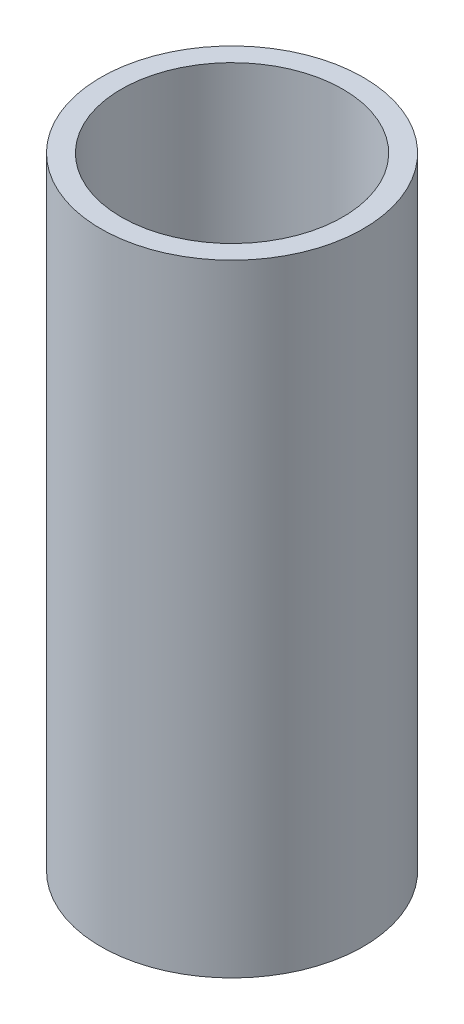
ISO-10303-21;
HEADER;
FILE_DESCRIPTION(('STEP AP214'),'2;1');
FILE_NAME('part.step','',(''),(''),'','','');
FILE_SCHEMA(('AUTOMOTIVE_DESIGN { 1 0 10303 214 1 1 1 1 }'));
ENDSEC;
DATA;
#1=APPLICATION_CONTEXT('core data for automotive mechanical design processes');
#2=APPLICATION_PROTOCOL_DEFINITION('international standard','automotive_design',2000,#1);
#3=PRODUCT_CONTEXT('',#1,'mechanical');
#4=PRODUCT('Part','Part','',(#3));
#5=PRODUCT_RELATED_PRODUCT_CATEGORY('part','',(#4));
#6=PRODUCT_DEFINITION_FORMATION('','',#4);
#7=PRODUCT_DEFINITION_CONTEXT('part definition',#1,'design');
#8=PRODUCT_DEFINITION('design','',#6,#7);
#9=PRODUCT_DEFINITION_SHAPE('','',#8);
#10=(LENGTH_UNIT() NAMED_UNIT(*) SI_UNIT(.MILLI.,.METRE.));
#11=(NAMED_UNIT(*) PLANE_ANGLE_UNIT() SI_UNIT($,.RADIAN.));
#12=(NAMED_UNIT(*) SI_UNIT($,.STERADIAN.) SOLID_ANGLE_UNIT());
#13=UNCERTAINTY_MEASURE_WITH_UNIT(LENGTH_MEASURE(1.E-05),#10,'distance_accuracy_value','');
#14=(GEOMETRIC_REPRESENTATION_CONTEXT(3) GLOBAL_UNCERTAINTY_ASSIGNED_CONTEXT((#13)) GLOBAL_UNIT_ASSIGNED_CONTEXT((#10,
#11,#12)) REPRESENTATION_CONTEXT('',''));
#15=CARTESIAN_POINT('',(0.,0.,0.));
#16=DIRECTION('',(0.,0.,1.));
#17=DIRECTION('',(1.,0.,0.));
#18=AXIS2_PLACEMENT_3D('',#15,#16,#17);
#19=CARTESIAN_POINT('',(0.,57.15,0.));
#20=DIRECTION('',(0.,-1.,0.));
#21=DIRECTION('',(0.,0.,-1.));
#22=AXIS2_PLACEMENT_3D('',#19,#20,#21);
#23=CYLINDRICAL_SURFACE('',#22,24.13);
#24=CARTESIAN_POINT('',(0.,57.15,0.));
#25=DIRECTION('',(0.,-1.,0.));
#26=DIRECTION('',(0.,0.,-1.));
#27=AXIS2_PLACEMENT_3D('',#24,#25,#26);
#28=CIRCLE('',#27,24.13);
#29=CARTESIAN_POINT('',(0.,57.15,-24.13));
#30=VERTEX_POINT('',#29);
#31=EDGE_CURVE('E17',#30,#30,#28,.F.);
#32=ORIENTED_EDGE('',*,*,#31,.F.);
#33=EDGE_LOOP('',(#32));
#34=FACE_BOUND('',#33,.T.);
#35=CARTESIAN_POINT('',(0.,-57.15,0.));
#36=DIRECTION('',(0.,-1.,0.));
#37=DIRECTION('',(0.,0.,-1.));
#38=AXIS2_PLACEMENT_3D('',#35,#36,#37);
#39=CIRCLE('',#38,24.13);
#40=CARTESIAN_POINT('',(0.,-57.15,-24.13));
#41=VERTEX_POINT('',#40);
#42=EDGE_CURVE('E26',#41,#41,#39,.F.);
#43=ORIENTED_EDGE('',*,*,#42,.T.);
#44=EDGE_LOOP('',(#43));
#45=FACE_BOUND('',#44,.T.);
#46=ADVANCED_FACE('F13',(#34,#45),#23,.T.);
#47=CARTESIAN_POINT('',(-24.41956,57.15,-24.41956));
#48=DIRECTION('',(0.,1.,0.));
#49=DIRECTION('',(0.,0.,1.));
#50=AXIS2_PLACEMENT_3D('',#47,#48,#49);
#51=PLANE('',#50);
#52=CARTESIAN_POINT('',(0.,57.15,0.));
#53=DIRECTION('',(0.,-1.,0.));
#54=DIRECTION('',(0.,0.,-1.));
#55=AXIS2_PLACEMENT_3D('',#52,#53,#54);
#56=CIRCLE('',#55,20.3708);
#57=CARTESIAN_POINT('',(0.,57.15,-20.3708));
#58=VERTEX_POINT('',#57);
#59=EDGE_CURVE('E21',#58,#58,#56,.F.);
#60=ORIENTED_EDGE('',*,*,#59,.F.);
#61=EDGE_LOOP('',(#60));
#62=FACE_BOUND('',#61,.T.);
#63=ORIENTED_EDGE('',*,*,#31,.T.);
#64=EDGE_LOOP('',(#63));
#65=FACE_BOUND('',#64,.T.);
#66=ADVANCED_FACE('F34',(#62,#65),#51,.T.);
#67=CARTESIAN_POINT('',(-24.41956,-57.15,-24.41956));
#68=DIRECTION('',(0.,1.,0.));
#69=DIRECTION('',(0.,0.,1.));
#70=AXIS2_PLACEMENT_3D('',#67,#68,#69);
#71=PLANE('',#70);
#72=CARTESIAN_POINT('',(0.,-57.15,0.));
#73=DIRECTION('',(0.,-1.,0.));
#74=DIRECTION('',(0.,0.,-1.));
#75=AXIS2_PLACEMENT_3D('',#72,#73,#74);
#76=CIRCLE('',#75,20.3708);
#77=CARTESIAN_POINT('',(0.,-57.15,-20.3708));
#78=VERTEX_POINT('',#77);
#79=EDGE_CURVE('E9',#78,#78,#76,.T.);
#80=ORIENTED_EDGE('',*,*,#79,.F.);
#81=EDGE_LOOP('',(#80));
#82=FACE_BOUND('',#81,.T.);
#83=ORIENTED_EDGE('',*,*,#42,.F.);
#84=EDGE_LOOP('',(#83));
#85=FACE_BOUND('',#84,.T.);
#86=ADVANCED_FACE('F15',(#82,#85),#71,.F.);
#87=CARTESIAN_POINT('',(0.,57.15,0.));
#88=DIRECTION('',(0.,-1.,0.));
#89=DIRECTION('',(0.,0.,-1.));
#90=AXIS2_PLACEMENT_3D('',#87,#88,#89);
#91=CYLINDRICAL_SURFACE('',#90,20.3708);
#92=ORIENTED_EDGE('',*,*,#79,.T.);
#93=EDGE_LOOP('',(#92));
#94=FACE_BOUND('',#93,.T.);
#95=ORIENTED_EDGE('',*,*,#59,.T.);
#96=EDGE_LOOP('',(#95));
#97=FACE_BOUND('',#96,.T.);
#98=ADVANCED_FACE('F44',(#94,#97),#91,.F.);
#99=CLOSED_SHELL('',(#46,#66,#86,#98));
#100=MANIFOLD_SOLID_BREP('B1',#99);
#101=ADVANCED_BREP_SHAPE_REPRESENTATION('',(#18,#100),#14);
#102=SHAPE_DEFINITION_REPRESENTATION(#9,#101);
ENDSEC;
END-ISO-10303-21;
